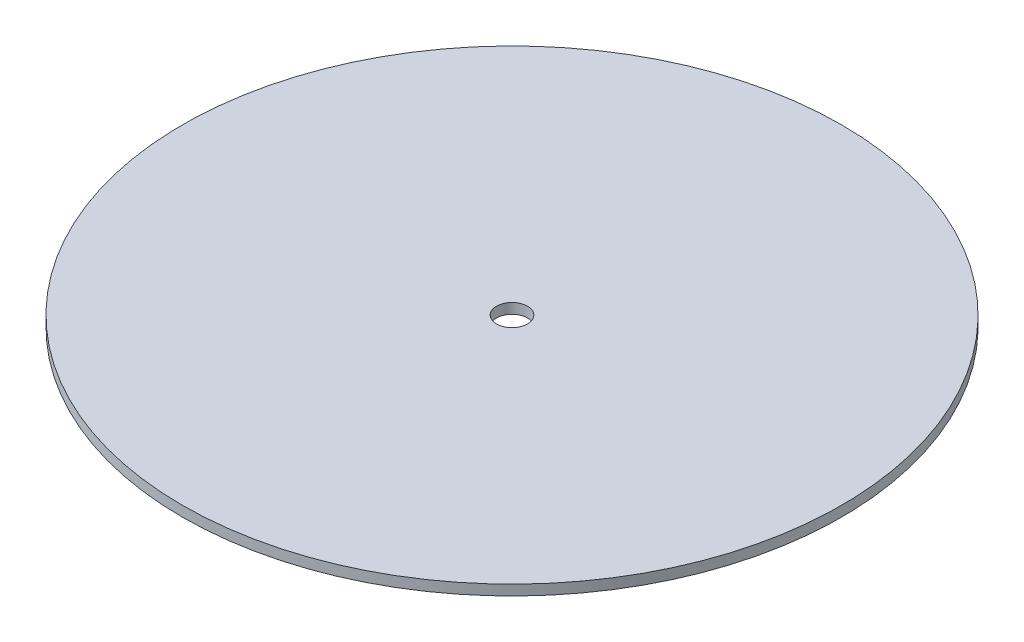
ISO-10303-21;
HEADER;
FILE_DESCRIPTION(('STEP AP214'),'2;1');
FILE_NAME('part.step','',(''),(''),'','','');
FILE_SCHEMA(('AUTOMOTIVE_DESIGN { 1 0 10303 214 1 1 1 1 }'));
ENDSEC;
DATA;
#1=APPLICATION_CONTEXT('core data for automotive mechanical design processes');
#2=APPLICATION_PROTOCOL_DEFINITION('international standard','automotive_design',2000,#1);
#3=PRODUCT_CONTEXT('',#1,'mechanical');
#4=PRODUCT('Part','Part','',(#3));
#5=PRODUCT_RELATED_PRODUCT_CATEGORY('part','',(#4));
#6=PRODUCT_DEFINITION_FORMATION('','',#4);
#7=PRODUCT_DEFINITION_CONTEXT('part definition',#1,'design');
#8=PRODUCT_DEFINITION('design','',#6,#7);
#9=PRODUCT_DEFINITION_SHAPE('','',#8);
#10=(LENGTH_UNIT() NAMED_UNIT(*) SI_UNIT(.MILLI.,.METRE.));
#11=(NAMED_UNIT(*) PLANE_ANGLE_UNIT() SI_UNIT($,.RADIAN.));
#12=(NAMED_UNIT(*) SI_UNIT($,.STERADIAN.) SOLID_ANGLE_UNIT());
#13=UNCERTAINTY_MEASURE_WITH_UNIT(LENGTH_MEASURE(1.E-05),#10,'distance_accuracy_value','');
#14=(GEOMETRIC_REPRESENTATION_CONTEXT(3) GLOBAL_UNCERTAINTY_ASSIGNED_CONTEXT((#13)) GLOBAL_UNIT_ASSIGNED_CONTEXT((#10,
#11,#12)) REPRESENTATION_CONTEXT('',''));
#15=CARTESIAN_POINT('',(0.,0.,0.));
#16=DIRECTION('',(0.,0.,1.));
#17=DIRECTION('',(1.,0.,0.));
#18=AXIS2_PLACEMENT_3D('',#15,#16,#17);
#19=CARTESIAN_POINT('',(0.,-6.35,0.));
#20=DIRECTION('',(0.,1.,0.));
#21=DIRECTION('',(0.,0.,1.));
#22=AXIS2_PLACEMENT_3D('',#19,#20,#21);
#23=CYLINDRICAL_SURFACE('',#22,203.2);
#24=CARTESIAN_POINT('',(0.,-6.35,0.));
#25=DIRECTION('',(0.,1.,0.));
#26=DIRECTION('',(0.,0.,1.));
#27=AXIS2_PLACEMENT_3D('',#24,#25,#26);
#28=CIRCLE('',#27,203.2);
#29=CARTESIAN_POINT('',(0.,-6.35,203.2));
#30=VERTEX_POINT('',#29);
#31=EDGE_CURVE('E10',#30,#30,#28,.T.);
#32=ORIENTED_EDGE('',*,*,#31,.T.);
#33=EDGE_LOOP('',(#32));
#34=FACE_BOUND('',#33,.T.);
#35=CARTESIAN_POINT('',(0.,0.,0.));
#36=DIRECTION('',(0.,1.,0.));
#37=DIRECTION('',(0.,0.,1.));
#38=AXIS2_PLACEMENT_3D('',#35,#36,#37);
#39=CIRCLE('',#38,203.2);
#40=CARTESIAN_POINT('',(0.,0.,203.2));
#41=VERTEX_POINT('',#40);
#42=EDGE_CURVE('E35',#41,#41,#39,.T.);
#43=ORIENTED_EDGE('',*,*,#42,.F.);
#44=EDGE_LOOP('',(#43));
#45=FACE_BOUND('',#44,.T.);
#46=ADVANCED_FACE('F29',(#34,#45),#23,.T.);
#47=CARTESIAN_POINT('',(0.,-6.35,0.));
#48=DIRECTION('',(0.,1.,0.));
#49=DIRECTION('',(0.,0.,1.));
#50=AXIS2_PLACEMENT_3D('',#47,#48,#49);
#51=PLANE('',#50);
#52=CARTESIAN_POINT('',(0.,-6.35,0.));
#53=DIRECTION('',(0.,1.,0.));
#54=DIRECTION('',(0.,0.,1.));
#55=AXIS2_PLACEMENT_3D('',#52,#53,#54);
#56=CIRCLE('',#55,9.525);
#57=CARTESIAN_POINT('',(0.,-6.35,9.525));
#58=VERTEX_POINT('',#57);
#59=EDGE_CURVE('E39',#58,#58,#56,.T.);
#60=ORIENTED_EDGE('',*,*,#59,.T.);
#61=EDGE_LOOP('',(#60));
#62=FACE_BOUND('',#61,.T.);
#63=ORIENTED_EDGE('',*,*,#31,.F.);
#64=EDGE_LOOP('',(#63));
#65=FACE_BOUND('',#64,.T.);
#66=ADVANCED_FACE('F53',(#62,#65),#51,.F.);
#67=CARTESIAN_POINT('',(0.,0.,0.));
#68=DIRECTION('',(0.,1.,0.));
#69=DIRECTION('',(0.,0.,1.));
#70=AXIS2_PLACEMENT_3D('',#67,#68,#69);
#71=PLANE('',#70);
#72=CARTESIAN_POINT('',(0.,0.,0.));
#73=DIRECTION('',(0.,1.,0.));
#74=DIRECTION('',(0.,0.,1.));
#75=AXIS2_PLACEMENT_3D('',#72,#73,#74);
#76=CIRCLE('',#75,9.525);
#77=CARTESIAN_POINT('',(0.,0.,9.525));
#78=VERTEX_POINT('',#77);
#79=EDGE_CURVE('E43',#78,#78,#76,.T.);
#80=ORIENTED_EDGE('',*,*,#79,.F.);
#81=EDGE_LOOP('',(#80));
#82=FACE_BOUND('',#81,.T.);
#83=ORIENTED_EDGE('',*,*,#42,.T.);
#84=EDGE_LOOP('',(#83));
#85=FACE_BOUND('',#84,.T.);
#86=ADVANCED_FACE('F51',(#82,#85),#71,.T.);
#87=CARTESIAN_POINT('',(0.,-6.35,0.));
#88=DIRECTION('',(0.,1.,0.));
#89=DIRECTION('',(0.,0.,1.));
#90=AXIS2_PLACEMENT_3D('',#87,#88,#89);
#91=CYLINDRICAL_SURFACE('',#90,9.525);
#92=ORIENTED_EDGE('',*,*,#59,.F.);
#93=EDGE_LOOP('',(#92));
#94=FACE_BOUND('',#93,.T.);
#95=ORIENTED_EDGE('',*,*,#79,.T.);
#96=EDGE_LOOP('',(#95));
#97=FACE_BOUND('',#96,.T.);
#98=ADVANCED_FACE('F49',(#94,#97),#91,.F.);
#99=CLOSED_SHELL('',(#46,#66,#86,#98));
#100=MANIFOLD_SOLID_BREP('B2',#99);
#101=ADVANCED_BREP_SHAPE_REPRESENTATION('',(#18,#100),#14);
#102=SHAPE_DEFINITION_REPRESENTATION(#9,#101);
ENDSEC;
END-ISO-10303-21;
